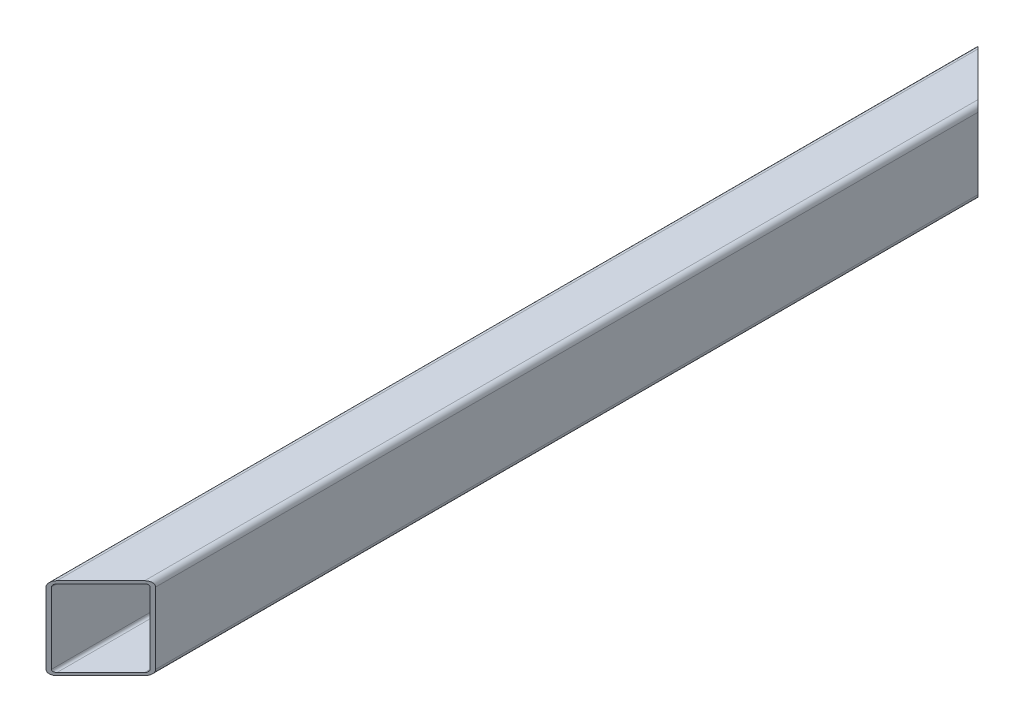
from build123d import *

# Parameters (mm, degrees)
BASE_EXTRU_MINCE_DEPTH  = 340
ENL_V_MAT_EXTRU_1_DEPTH = 60


with BuildPart() as part:
    # Esquisse1 → Base-Extru.-Mince (new, symmetric)
    with BuildSketch(Plane.XY):
        with BuildLine():
            Line((16, 30), (-16, 30))
            ThreePointArc((-16, 30), (-18.828427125, 28.828427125), (-20, 26))
            Line((-20, 26), (-20, -26))
            ThreePointArc((-20, -26), (-18.828427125, -28.828427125), (-16, -30))
            Line((-16, -30), (16, -30))
            ThreePointArc((16, -30), (18.828427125, -28.828427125), (20, -26))
            Line((20, -26), (20, 26))
            ThreePointArc((20, 26), (18.828427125, 28.828427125), (16, 30))
        make_face()
        with BuildLine():
            Line((16, 28), (-16, 28))
            ThreePointArc((-16, 28), (-17.414213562, 27.414213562), (-18, 26))
            Line((-18, 26), (-18, -26))
            ThreePointArc((-18, -26), (-17.414213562, -27.414213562), (-16, -28))
            Line((-16, -28), (16, -28))
            ThreePointArc((16, -28), (17.414213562, -27.414213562), (18, -26))
            Line((18, -26), (18, 26))
            ThreePointArc((18, 26), (17.414213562, 27.414213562), (16, 28))
        make_face(mode=Mode.SUBTRACT)
    extrude(amount=BASE_EXTRU_MINCE_DEPTH, both=True)

    # Esquisse2 → Enl_v. mat.-Extru.1 (cut)
    with BuildSketch(Plane(origin=(0, 30, 0), x_dir=(-1, 0, 0), z_dir=(0, 1, 0))):
        Polygon((20, -340), (-20, -300), (-20, -340), align=None)
        Polygon((20, 340), (-20, 300), (-20, 340), align=None)
    extrude(amount=-ENL_V_MAT_EXTRU_1_DEPTH, mode=Mode.SUBTRACT)


solid = part.part
